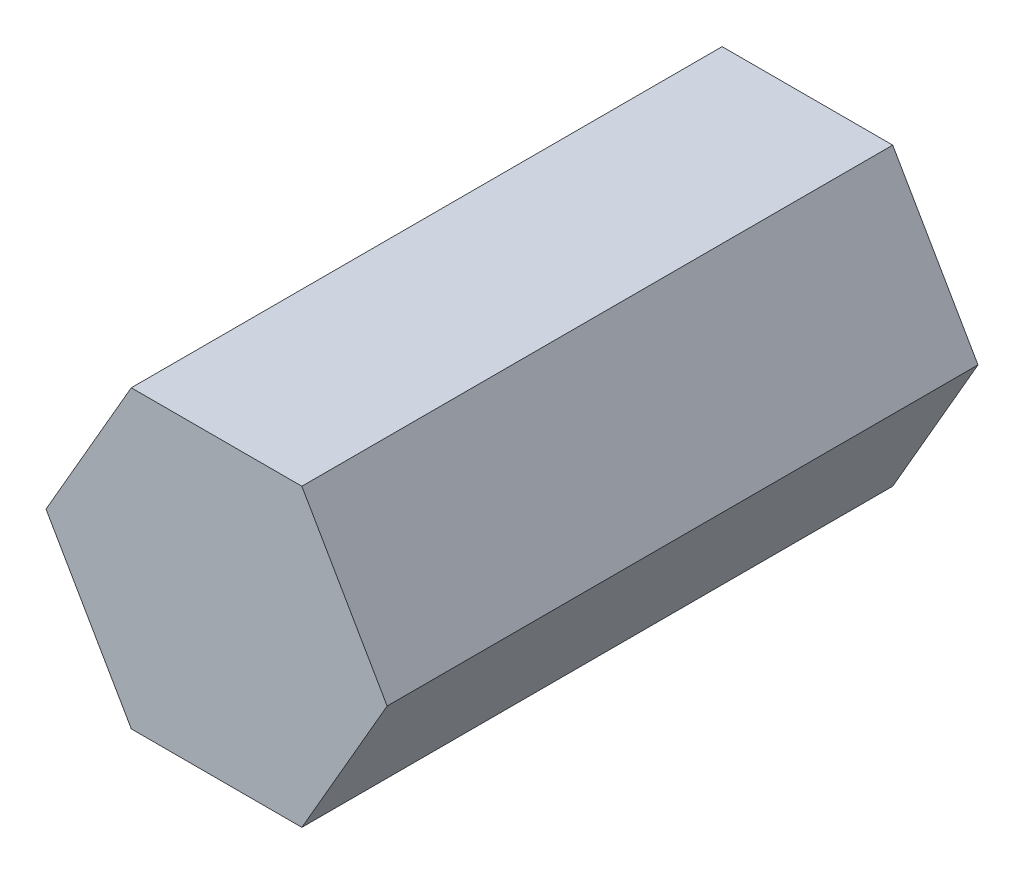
ISO-10303-21;
HEADER;
FILE_DESCRIPTION(('STEP AP214'),'2;1');
FILE_NAME('part.step','',(''),(''),'','','');
FILE_SCHEMA(('AUTOMOTIVE_DESIGN { 1 0 10303 214 1 1 1 1 }'));
ENDSEC;
DATA;
#1=APPLICATION_CONTEXT('core data for automotive mechanical design processes');
#2=APPLICATION_PROTOCOL_DEFINITION('international standard','automotive_design',2000,#1);
#3=PRODUCT_CONTEXT('',#1,'mechanical');
#4=PRODUCT('Part','Part','',(#3));
#5=PRODUCT_RELATED_PRODUCT_CATEGORY('part','',(#4));
#6=PRODUCT_DEFINITION_FORMATION('','',#4);
#7=PRODUCT_DEFINITION_CONTEXT('part definition',#1,'design');
#8=PRODUCT_DEFINITION('design','',#6,#7);
#9=PRODUCT_DEFINITION_SHAPE('','',#8);
#10=(LENGTH_UNIT() NAMED_UNIT(*) SI_UNIT(.MILLI.,.METRE.));
#11=(NAMED_UNIT(*) PLANE_ANGLE_UNIT() SI_UNIT($,.RADIAN.));
#12=(NAMED_UNIT(*) SI_UNIT($,.STERADIAN.) SOLID_ANGLE_UNIT());
#13=UNCERTAINTY_MEASURE_WITH_UNIT(LENGTH_MEASURE(1.E-05),#10,'distance_accuracy_value','');
#14=(GEOMETRIC_REPRESENTATION_CONTEXT(3) GLOBAL_UNCERTAINTY_ASSIGNED_CONTEXT((#13)) GLOBAL_UNIT_ASSIGNED_CONTEXT((#10,
#11,#12)) REPRESENTATION_CONTEXT('',''));
#15=CARTESIAN_POINT('',(0.,0.,0.));
#16=DIRECTION('',(0.,0.,1.));
#17=DIRECTION('',(1.,0.,0.));
#18=AXIS2_PLACEMENT_3D('',#15,#16,#17);
#19=CARTESIAN_POINT('',(0.866025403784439,-1.5,6.));
#20=DIRECTION('',(-0.866025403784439,0.5,0.));
#21=DIRECTION('',(-0.5,-0.866025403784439,0.));
#22=AXIS2_PLACEMENT_3D('',#19,#20,#21);
#23=PLANE('',#22);
#24=DIRECTION('',(0.499999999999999,0.866025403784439,0.));
#25=VECTOR('',#24,1.);
#26=CARTESIAN_POINT('',(0.866025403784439,-1.5,0.));
#27=LINE('',#26,#25);
#28=CARTESIAN_POINT('',(0.866025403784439,-1.5,0.));
#29=VERTEX_POINT('',#28);
#30=CARTESIAN_POINT('',(1.73205080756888,0.,0.));
#31=VERTEX_POINT('',#30);
#32=EDGE_CURVE('E86',#29,#31,#27,.T.);
#33=ORIENTED_EDGE('',*,*,#32,.T.);
#34=DIRECTION('',(0.,0.,-1.));
#35=VECTOR('',#34,1.);
#36=CARTESIAN_POINT('',(1.73205080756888,0.,6.));
#37=LINE('',#36,#35);
#38=CARTESIAN_POINT('',(1.73205080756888,0.,6.));
#39=VERTEX_POINT('',#38);
#40=EDGE_CURVE('E11',#39,#31,#37,.T.);
#41=ORIENTED_EDGE('',*,*,#40,.F.);
#42=DIRECTION('',(0.499999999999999,0.866025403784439,0.));
#43=VECTOR('',#42,1.);
#44=CARTESIAN_POINT('',(0.866025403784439,-1.5,6.));
#45=LINE('',#44,#43);
#46=CARTESIAN_POINT('',(0.866025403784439,-1.5,6.));
#47=VERTEX_POINT('',#46);
#48=EDGE_CURVE('E109',#47,#39,#45,.T.);
#49=ORIENTED_EDGE('',*,*,#48,.F.);
#50=DIRECTION('',(0.,0.,-1.));
#51=VECTOR('',#50,1.);
#52=CARTESIAN_POINT('',(0.866025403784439,-1.5,6.));
#53=LINE('',#52,#51);
#54=EDGE_CURVE('E99',#47,#29,#53,.T.);
#55=ORIENTED_EDGE('',*,*,#54,.T.);
#56=EDGE_LOOP('',(#33,#41,#49,#55));
#57=FACE_BOUND('',#56,.T.);
#58=ADVANCED_FACE('F30',(#57),#23,.F.);
#59=CARTESIAN_POINT('',(1.73205080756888,0.,6.));
#60=DIRECTION('',(-0.866025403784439,-0.5,0.));
#61=DIRECTION('',(0.5,-0.866025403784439,0.));
#62=AXIS2_PLACEMENT_3D('',#59,#60,#61);
#63=PLANE('',#62);
#64=DIRECTION('',(-0.5,0.866025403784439,0.));
#65=VECTOR('',#64,1.);
#66=CARTESIAN_POINT('',(1.73205080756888,0.,0.));
#67=LINE('',#66,#65);
#68=CARTESIAN_POINT('',(0.866025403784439,1.5,0.));
#69=VERTEX_POINT('',#68);
#70=EDGE_CURVE('E82',#31,#69,#67,.T.);
#71=ORIENTED_EDGE('',*,*,#70,.T.);
#72=DIRECTION('',(0.,0.,-1.));
#73=VECTOR('',#72,1.);
#74=CARTESIAN_POINT('',(0.866025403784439,1.5,6.));
#75=LINE('',#74,#73);
#76=CARTESIAN_POINT('',(0.866025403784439,1.5,6.));
#77=VERTEX_POINT('',#76);
#78=EDGE_CURVE('E37',#77,#69,#75,.T.);
#79=ORIENTED_EDGE('',*,*,#78,.F.);
#80=DIRECTION('',(-0.5,0.866025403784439,0.));
#81=VECTOR('',#80,1.);
#82=CARTESIAN_POINT('',(1.73205080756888,0.,6.));
#83=LINE('',#82,#81);
#84=EDGE_CURVE('E95',#39,#77,#83,.T.);
#85=ORIENTED_EDGE('',*,*,#84,.F.);
#86=ORIENTED_EDGE('',*,*,#40,.T.);
#87=EDGE_LOOP('',(#71,#79,#85,#86));
#88=FACE_BOUND('',#87,.T.);
#89=ADVANCED_FACE('F94',(#88),#63,.F.);
#90=CARTESIAN_POINT('',(0.866025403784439,1.5,6.));
#91=DIRECTION('',(0.,-1.,0.));
#92=DIRECTION('',(1.,0.,0.));
#93=AXIS2_PLACEMENT_3D('',#90,#91,#92);
#94=PLANE('',#93);
#95=DIRECTION('',(-1.,0.,0.));
#96=VECTOR('',#95,1.);
#97=CARTESIAN_POINT('',(0.866025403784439,1.5,0.));
#98=LINE('',#97,#96);
#99=CARTESIAN_POINT('',(-0.866025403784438,1.5,0.));
#100=VERTEX_POINT('',#99);
#101=EDGE_CURVE('E88',#69,#100,#98,.T.);
#102=ORIENTED_EDGE('',*,*,#101,.T.);
#103=DIRECTION('',(0.,0.,-1.));
#104=VECTOR('',#103,1.);
#105=CARTESIAN_POINT('',(-0.866025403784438,1.5,6.));
#106=LINE('',#105,#104);
#107=CARTESIAN_POINT('',(-0.866025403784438,1.5,6.));
#108=VERTEX_POINT('',#107);
#109=EDGE_CURVE('E125',#108,#100,#106,.T.);
#110=ORIENTED_EDGE('',*,*,#109,.F.);
#111=DIRECTION('',(-1.,0.,0.));
#112=VECTOR('',#111,1.);
#113=CARTESIAN_POINT('',(0.866025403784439,1.5,6.));
#114=LINE('',#113,#112);
#115=EDGE_CURVE('E112',#77,#108,#114,.T.);
#116=ORIENTED_EDGE('',*,*,#115,.F.);
#117=ORIENTED_EDGE('',*,*,#78,.T.);
#118=EDGE_LOOP('',(#102,#110,#116,#117));
#119=FACE_BOUND('',#118,.T.);
#120=ADVANCED_FACE('F129',(#119),#94,.F.);
#121=CARTESIAN_POINT('',(-0.866025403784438,1.5,6.));
#122=DIRECTION('',(0.866025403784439,-0.5,0.));
#123=DIRECTION('',(0.5,0.866025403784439,0.));
#124=AXIS2_PLACEMENT_3D('',#121,#122,#123);
#125=PLANE('',#124);
#126=DIRECTION('',(-0.5,-0.866025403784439,0.));
#127=VECTOR('',#126,1.);
#128=CARTESIAN_POINT('',(-0.866025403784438,1.5,0.));
#129=LINE('',#128,#127);
#130=CARTESIAN_POINT('',(-1.73205080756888,0.,0.));
#131=VERTEX_POINT('',#130);
#132=EDGE_CURVE('E103',#100,#131,#129,.T.);
#133=ORIENTED_EDGE('',*,*,#132,.T.);
#134=DIRECTION('',(0.,0.,-1.));
#135=VECTOR('',#134,1.);
#136=CARTESIAN_POINT('',(-1.73205080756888,0.,6.));
#137=LINE('',#136,#135);
#138=CARTESIAN_POINT('',(-1.73205080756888,0.,6.));
#139=VERTEX_POINT('',#138);
#140=EDGE_CURVE('E122',#139,#131,#137,.T.);
#141=ORIENTED_EDGE('',*,*,#140,.F.);
#142=DIRECTION('',(-0.5,-0.866025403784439,0.));
#143=VECTOR('',#142,1.);
#144=CARTESIAN_POINT('',(-0.866025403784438,1.5,6.));
#145=LINE('',#144,#143);
#146=EDGE_CURVE('E114',#108,#139,#145,.T.);
#147=ORIENTED_EDGE('',*,*,#146,.F.);
#148=ORIENTED_EDGE('',*,*,#109,.T.);
#149=EDGE_LOOP('',(#133,#141,#147,#148));
#150=FACE_BOUND('',#149,.T.);
#151=ADVANCED_FACE('F135',(#150),#125,.F.);
#152=CARTESIAN_POINT('',(-1.73205080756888,0.,6.));
#153=DIRECTION('',(0.866025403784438,0.500000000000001,0.));
#154=DIRECTION('',(-0.500000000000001,0.866025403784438,0.));
#155=AXIS2_PLACEMENT_3D('',#152,#153,#154);
#156=PLANE('',#155);
#157=DIRECTION('',(0.500000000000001,-0.866025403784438,0.));
#158=VECTOR('',#157,1.);
#159=CARTESIAN_POINT('',(-1.73205080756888,0.,0.));
#160=LINE('',#159,#158);
#161=CARTESIAN_POINT('',(-0.866025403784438,-1.5,0.));
#162=VERTEX_POINT('',#161);
#163=EDGE_CURVE('E105',#131,#162,#160,.T.);
#164=ORIENTED_EDGE('',*,*,#163,.T.);
#165=DIRECTION('',(0.,0.,-1.));
#166=VECTOR('',#165,1.);
#167=CARTESIAN_POINT('',(-0.866025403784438,-1.5,6.));
#168=LINE('',#167,#166);
#169=CARTESIAN_POINT('',(-0.866025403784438,-1.5,6.));
#170=VERTEX_POINT('',#169);
#171=EDGE_CURVE('E119',#170,#162,#168,.T.);
#172=ORIENTED_EDGE('',*,*,#171,.F.);
#173=DIRECTION('',(0.500000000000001,-0.866025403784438,0.));
#174=VECTOR('',#173,1.);
#175=CARTESIAN_POINT('',(-1.73205080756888,0.,6.));
#176=LINE('',#175,#174);
#177=EDGE_CURVE('E49',#139,#170,#176,.T.);
#178=ORIENTED_EDGE('',*,*,#177,.F.);
#179=ORIENTED_EDGE('',*,*,#140,.T.);
#180=EDGE_LOOP('',(#164,#172,#178,#179));
#181=FACE_BOUND('',#180,.T.);
#182=ADVANCED_FACE('F138',(#181),#156,.F.);
#183=CARTESIAN_POINT('',(-0.866025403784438,-1.5,6.));
#184=DIRECTION('',(0.,1.,0.));
#185=DIRECTION('',(0.,0.,1.));
#186=AXIS2_PLACEMENT_3D('',#183,#184,#185);
#187=PLANE('',#186);
#188=DIRECTION('',(1.,0.,0.));
#189=VECTOR('',#188,1.);
#190=CARTESIAN_POINT('',(-0.866025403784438,-1.5,0.));
#191=LINE('',#190,#189);
#192=EDGE_CURVE('E107',#162,#29,#191,.T.);
#193=ORIENTED_EDGE('',*,*,#192,.T.);
#194=ORIENTED_EDGE('',*,*,#54,.F.);
#195=DIRECTION('',(1.,0.,0.));
#196=VECTOR('',#195,1.);
#197=CARTESIAN_POINT('',(-0.866025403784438,-1.5,6.));
#198=LINE('',#197,#196);
#199=EDGE_CURVE('E44',#170,#47,#198,.T.);
#200=ORIENTED_EDGE('',*,*,#199,.F.);
#201=ORIENTED_EDGE('',*,*,#171,.T.);
#202=EDGE_LOOP('',(#193,#194,#200,#201));
#203=FACE_BOUND('',#202,.T.);
#204=ADVANCED_FACE('F140',(#203),#187,.F.);
#205=CARTESIAN_POINT('',(0.866025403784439,-1.5,6.));
#206=DIRECTION('',(0.,0.,-1.));
#207=DIRECTION('',(-1.,0.,0.));
#208=AXIS2_PLACEMENT_3D('',#205,#206,#207);
#209=PLANE('',#208);
#210=ORIENTED_EDGE('',*,*,#48,.T.);
#211=ORIENTED_EDGE('',*,*,#84,.T.);
#212=ORIENTED_EDGE('',*,*,#115,.T.);
#213=ORIENTED_EDGE('',*,*,#146,.T.);
#214=ORIENTED_EDGE('',*,*,#177,.T.);
#215=ORIENTED_EDGE('',*,*,#199,.T.);
#216=EDGE_LOOP('',(#210,#211,#212,#213,#214,#215));
#217=FACE_BOUND('',#216,.T.);
#218=ADVANCED_FACE('F132',(#217),#209,.F.);
#219=CARTESIAN_POINT('',(0.866025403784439,-1.5,0.));
#220=DIRECTION('',(0.,0.,-1.));
#221=DIRECTION('',(-1.,0.,0.));
#222=AXIS2_PLACEMENT_3D('',#219,#220,#221);
#223=PLANE('',#222);
#224=ORIENTED_EDGE('',*,*,#32,.F.);
#225=ORIENTED_EDGE('',*,*,#192,.F.);
#226=ORIENTED_EDGE('',*,*,#163,.F.);
#227=ORIENTED_EDGE('',*,*,#132,.F.);
#228=ORIENTED_EDGE('',*,*,#101,.F.);
#229=ORIENTED_EDGE('',*,*,#70,.F.);
#230=EDGE_LOOP('',(#224,#225,#226,#227,#228,#229));
#231=FACE_BOUND('',#230,.T.);
#232=ADVANCED_FACE('F83',(#231),#223,.T.);
#233=CLOSED_SHELL('',(#58,#89,#120,#151,#182,#204,#218,#232));
#234=MANIFOLD_SOLID_BREP('B2',#233);
#235=ADVANCED_BREP_SHAPE_REPRESENTATION('',(#18,#234),#14);
#236=SHAPE_DEFINITION_REPRESENTATION(#9,#235);
ENDSEC;
END-ISO-10303-21;
